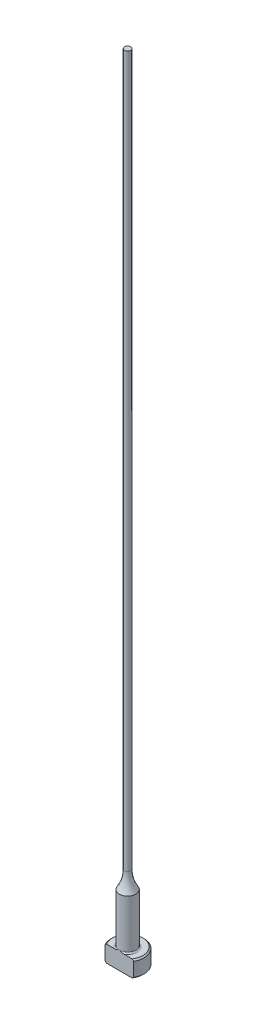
from build123d import *

# Parameters (mm, degrees)
CHAMFER1_SIZE      = 0.254
FILLET1_R          = 0.254
CUT_EXTRUDE1_DEPTH = 153.466131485


with BuildPart() as part:
    # Sketch1 → Revolve1 (revolve)
    with BuildSketch(Plane.XY, mode=Mode.PRIVATE) as revolve1_sk:
        with BuildLine():
            Line((0, 0), (-3.175, 0))
            Line((-3.175, 0), (-3.175, 3.175))
            Line((-3.175, 3.175), (-1.5875, 3.175))
            Line((-1.5875, 3.175), (-1.5875, 12.7))
            ThreePointArc((-1.5875, 12.7), (-0.847698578, 14.334042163), (-0.59436, 16.109772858))
            Line((-0.59436, 16.109772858), (-0.59436, 152.4))
            Line((-0.59436, 152.4), (0, 152.4))
            Line((0, 152.4), (0, 0))
        make_face()
    revolve(revolve1_sk.sketch.rotate(Axis((0, 259.958771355, 0), (0, -1, 0)), 270), axis=Axis((0, 259.958771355, 0), (0, -1, 0)))

    # Chamfer1
    chamfer1_edges = [part.edges().sort_by_distance(p)[0] for p in [
        (0, 0, -3.175),
        (0, 3.175, -3.175),
    ]]
    chamfer(chamfer1_edges, length=CHAMFER1_SIZE)

    # Fillet1
    fillet1_edges = [part.edges().sort_by_distance(p)[0] for p in [
        (0, 3.175, -1.5875),
    ]]
    fillet(fillet1_edges, radius=FILLET1_R)

    # Sketch2 → Cut-Extrude1 (cut, through all)
    with BuildSketch(Plane.XZ):
        with BuildLine():
            Line((-2.749630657, 1.5875), (2.749630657, 1.5875))
            ThreePointArc((2.749630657, 1.5875), (0, 3.175), (-2.749630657, 1.5875))
        make_face()
    extrude(amount=-CUT_EXTRUDE1_DEPTH, mode=Mode.SUBTRACT)


solid = part.part
